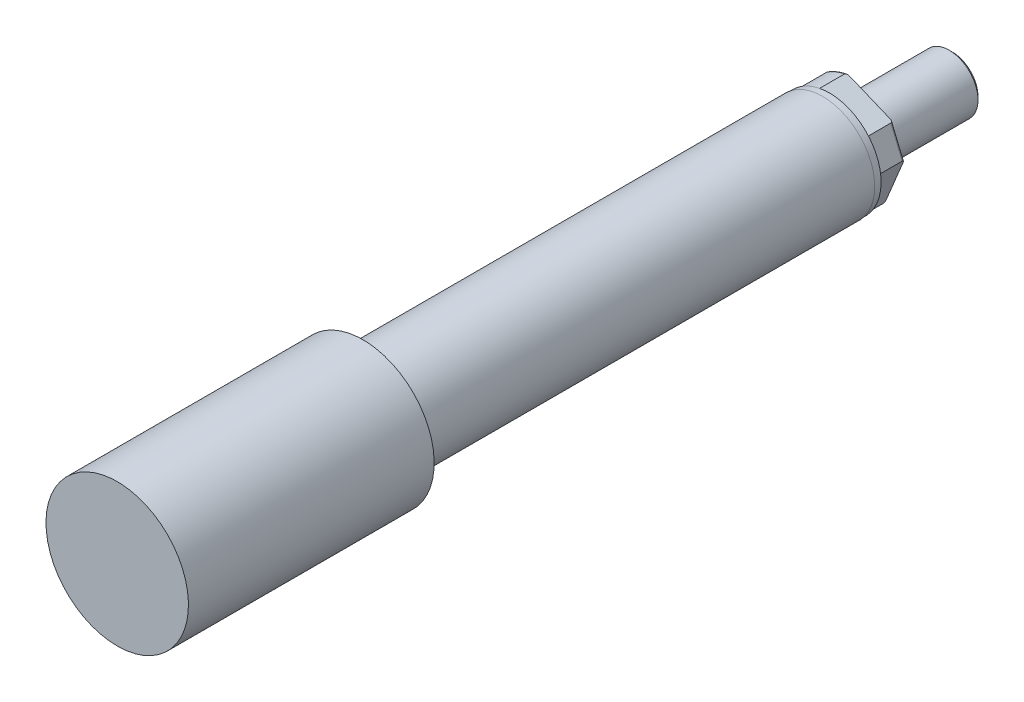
ISO-10303-21;
HEADER;
FILE_DESCRIPTION(('STEP AP214'),'2;1');
FILE_NAME('part.step','',(''),(''),'','','');
FILE_SCHEMA(('AUTOMOTIVE_DESIGN { 1 0 10303 214 1 1 1 1 }'));
ENDSEC;
DATA;
#1=APPLICATION_CONTEXT('core data for automotive mechanical design processes');
#2=APPLICATION_PROTOCOL_DEFINITION('international standard','automotive_design',2000,#1);
#3=PRODUCT_CONTEXT('',#1,'mechanical');
#4=PRODUCT('Part','Part','',(#3));
#5=PRODUCT_RELATED_PRODUCT_CATEGORY('part','',(#4));
#6=PRODUCT_DEFINITION_FORMATION('','',#4);
#7=PRODUCT_DEFINITION_CONTEXT('part definition',#1,'design');
#8=PRODUCT_DEFINITION('design','',#6,#7);
#9=PRODUCT_DEFINITION_SHAPE('','',#8);
#10=(LENGTH_UNIT() NAMED_UNIT(*) SI_UNIT(.MILLI.,.METRE.));
#11=(NAMED_UNIT(*) PLANE_ANGLE_UNIT() SI_UNIT($,.RADIAN.));
#12=(NAMED_UNIT(*) SI_UNIT($,.STERADIAN.) SOLID_ANGLE_UNIT());
#13=UNCERTAINTY_MEASURE_WITH_UNIT(LENGTH_MEASURE(1.E-05),#10,'distance_accuracy_value','');
#14=(GEOMETRIC_REPRESENTATION_CONTEXT(3) GLOBAL_UNCERTAINTY_ASSIGNED_CONTEXT((#13)) GLOBAL_UNIT_ASSIGNED_CONTEXT((#10,
#11,#12)) REPRESENTATION_CONTEXT('',''));
#15=CARTESIAN_POINT('',(0.,0.,0.));
#16=DIRECTION('',(0.,0.,1.));
#17=DIRECTION('',(1.,0.,0.));
#18=AXIS2_PLACEMENT_3D('',#15,#16,#17);
#19=CARTESIAN_POINT('',(0.,0.,-310.0327999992));
#20=DIRECTION('',(0.,0.,1.));
#21=DIRECTION('',(0.923879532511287,-0.382683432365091,0.));
#22=AXIS2_PLACEMENT_3D('',#19,#20,#21);
#23=CYLINDRICAL_SURFACE('',#22,37.719);
#24=CARTESIAN_POINT('',(0.,0.,-370.1799999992));
#25=DIRECTION('',(0.,0.,1.));
#26=DIRECTION('',(0.923879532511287,-0.382683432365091,0.));
#27=AXIS2_PLACEMENT_3D('',#24,#25,#26);
#28=CIRCLE('',#27,37.719);
#29=CARTESIAN_POINT('',(34.8478120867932,-14.4344363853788,-370.1799999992));
#30=VERTEX_POINT('',#29);
#31=EDGE_CURVE('E137',#30,#30,#28,.T.);
#32=ORIENTED_EDGE('',*,*,#31,.F.);
#33=EDGE_LOOP('',(#32));
#34=FACE_BOUND('',#33,.T.);
#35=CARTESIAN_POINT('',(0.,0.,-375.1799999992));
#36=DIRECTION('',(0.,0.,-1.));
#37=DIRECTION('',(-0.923879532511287,0.382683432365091,0.));
#38=AXIS2_PLACEMENT_3D('',#35,#36,#37);
#39=CIRCLE('',#38,37.719);
#40=CARTESIAN_POINT('',(-34.8478120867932,14.4344363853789,-375.1799999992));
#41=VERTEX_POINT('',#40);
#42=EDGE_CURVE('E173',#41,#41,#39,.T.);
#43=ORIENTED_EDGE('',*,*,#42,.F.);
#44=EDGE_LOOP('',(#43));
#45=FACE_BOUND('',#44,.T.);
#46=ADVANCED_FACE('F16',(#34,#45),#23,.T.);
#47=CARTESIAN_POINT('',(14.4344363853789,34.8478120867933,-395.1799999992));
#48=DIRECTION('',(0.,0.,1.));
#49=DIRECTION('',(0.923879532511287,-0.382683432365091,0.));
#50=AXIS2_PLACEMENT_3D('',#47,#48,#49);
#51=PLANE('',#50);
#52=CARTESIAN_POINT('',(0.,0.,-395.1799999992));
#53=DIRECTION('',(0.,0.,1.));
#54=DIRECTION('',(0.923879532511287,-0.382683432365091,0.));
#55=AXIS2_PLACEMENT_3D('',#52,#53,#54);
#56=CIRCLE('',#55,18.495999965);
#57=CARTESIAN_POINT('',(17.088075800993,-7.07811275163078,-395.1799999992));
#58=VERTEX_POINT('',#57);
#59=EDGE_CURVE('E158',#58,#58,#56,.T.);
#60=ORIENTED_EDGE('',*,*,#59,.T.);
#61=EDGE_LOOP('',(#60));
#62=FACE_BOUND('',#61,.T.);
#63=DIRECTION('',(0.923879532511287,-0.382683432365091,0.));
#64=VECTOR('',#63,1.);
#65=CARTESIAN_POINT('',(40.5034519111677,16.7770791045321,-395.1799999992));
#66=LINE('',#65,#64);
#67=CARTESIAN_POINT('',(-4.93911886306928,35.6000082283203,-395.1799999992));
#68=VERTEX_POINT('',#67);
#69=CARTESIAN_POINT('',(24.3744280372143,23.4579395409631,-395.1799999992));
#70=VERTEX_POINT('',#69);
#71=EDGE_CURVE('E153',#68,#70,#66,.T.);
#72=ORIENTED_EDGE('',*,*,#71,.T.);
#73=DIRECTION('',(-0.382683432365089,0.923879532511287,0.));
#74=VECTOR('',#73,1.);
#75=CARTESIAN_POINT('',(18.8918219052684,36.6941216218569,-395.1799999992));
#76=LINE('',#75,#74);
#77=CARTESIAN_POINT('',(33.8225914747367,0.648055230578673,-395.1799999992));
#78=VERTEX_POINT('',#77);
#79=EDGE_CURVE('E269',#70,#78,#76,.F.);
#80=ORIENTED_EDGE('',*,*,#79,.T.);
#81=DIRECTION('',(-0.382683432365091,-0.923879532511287,0.));
#82=VECTOR('',#81,1.);
#83=CARTESIAN_POINT('',(40.5034519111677,16.7770791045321,-395.1799999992));
#84=LINE('',#83,#82);
#85=CARTESIAN_POINT('',(21.6805227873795,-28.6654916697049,-395.1799999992));
#86=VERTEX_POINT('',#85);
#87=EDGE_CURVE('E143',#78,#86,#84,.T.);
#88=ORIENTED_EDGE('',*,*,#87,.T.);
#89=CARTESIAN_POINT('',(0.,0.,-395.1799999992));
#90=DIRECTION('',(0.,0.,1.));
#91=DIRECTION('',(0.923879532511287,-0.382683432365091,0.));
#92=AXIS2_PLACEMENT_3D('',#89,#90,#91);
#93=CIRCLE('',#92,35.941);
#94=CARTESIAN_POINT('',(4.93911886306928,-35.6000082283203,-395.1799999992));
#95=VERTEX_POINT('',#94);
#96=EDGE_CURVE('E284',#86,#95,#93,.F.);
#97=ORIENTED_EDGE('',*,*,#96,.T.);
#98=DIRECTION('',(-0.923879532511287,0.382683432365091,0.));
#99=VECTOR('',#98,1.);
#100=CARTESIAN_POINT('',(16.7770791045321,-40.5034519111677,-395.1799999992));
#101=LINE('',#100,#99);
#102=CARTESIAN_POINT('',(-28.6654916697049,-21.6805227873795,-395.1799999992));
#103=VERTEX_POINT('',#102);
#104=EDGE_CURVE('E146',#95,#103,#101,.T.);
#105=ORIENTED_EDGE('',*,*,#104,.T.);
#106=CARTESIAN_POINT('',(0.,0.,-395.1799999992));
#107=DIRECTION('',(0.,0.,1.));
#108=DIRECTION('',(0.923879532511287,-0.382683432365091,0.));
#109=AXIS2_PLACEMENT_3D('',#106,#107,#108);
#110=CIRCLE('',#109,35.941);
#111=CARTESIAN_POINT('',(-35.6000082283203,-4.93911886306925,-395.1799999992));
#112=VERTEX_POINT('',#111);
#113=EDGE_CURVE('E282',#103,#112,#110,.F.);
#114=ORIENTED_EDGE('',*,*,#113,.T.);
#115=DIRECTION('',(0.382683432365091,0.923879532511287,0.));
#116=VECTOR('',#115,1.);
#117=CARTESIAN_POINT('',(-16.777079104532,40.5034519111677,-395.1799999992));
#118=LINE('',#117,#116);
#119=CARTESIAN_POINT('',(-21.6805227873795,28.6654916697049,-395.1799999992));
#120=VERTEX_POINT('',#119);
#121=EDGE_CURVE('E150',#112,#120,#118,.T.);
#122=ORIENTED_EDGE('',*,*,#121,.T.);
#123=CARTESIAN_POINT('',(0.,0.,-395.1799999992));
#124=DIRECTION('',(0.,0.,1.));
#125=DIRECTION('',(0.923879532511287,-0.382683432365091,0.));
#126=AXIS2_PLACEMENT_3D('',#123,#124,#125);
#127=CIRCLE('',#126,35.941);
#128=EDGE_CURVE('E285',#120,#68,#127,.F.);
#129=ORIENTED_EDGE('',*,*,#128,.T.);
#130=EDGE_LOOP('',(#72,#80,#88,#97,#105,#114,#122,#129));
#131=FACE_BOUND('',#130,.T.);
#132=ADVANCED_FACE('F235',(#62,#131),#51,.F.);
#133=CARTESIAN_POINT('',(16.7770791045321,-40.5034519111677,-375.1799999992));
#134=DIRECTION('',(-0.382683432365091,-0.923879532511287,0.));
#135=DIRECTION('',(0.,0.,-1.));
#136=AXIS2_PLACEMENT_3D('',#133,#134,#135);
#137=PLANE('',#136);
#138=ORIENTED_EDGE('',*,*,#104,.F.);
#139=CARTESIAN_POINT('',(4.93911886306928,-35.6000082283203,-395.1799999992));
#140=CARTESIAN_POINT('',(4.99832987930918,-35.6245342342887,-395.179997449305));
#141=CARTESIAN_POINT('',(5.05753718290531,-35.6490587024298,-395.178965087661));
#142=CARTESIAN_POINT('',(5.17589592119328,-35.698084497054,-395.174771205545));
#143=CARTESIAN_POINT('',(5.2350473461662,-35.7225858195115,-395.171609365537));
#144=CARTESIAN_POINT('',(5.41269190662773,-35.7961686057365,-395.158798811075));
#145=CARTESIAN_POINT('',(5.53100031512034,-35.8451735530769,-395.145824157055));
#146=CARTESIAN_POINT('',(5.76714438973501,-35.9429876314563,-395.110075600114));
#147=CARTESIAN_POINT('',(5.88497196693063,-35.9917934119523,-395.087238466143));
#148=CARTESIAN_POINT('',(6.11821347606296,-36.0884052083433,-395.030530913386));
#149=CARTESIAN_POINT('',(6.23363092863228,-36.1362126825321,-394.996677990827));
#150=CARTESIAN_POINT('',(6.43254813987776,-36.2186068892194,-394.926075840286));
#151=CARTESIAN_POINT('',(6.51688700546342,-36.2535411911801,-394.89210972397));
#152=CARTESIAN_POINT('',(6.6823092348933,-36.322061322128,-394.815821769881));
#153=CARTESIAN_POINT('',(6.76339350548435,-36.355647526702,-394.773502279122));
#154=CARTESIAN_POINT('',(6.92130537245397,-36.4210567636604,-394.678775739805));
#155=CARTESIAN_POINT('',(6.99809311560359,-36.452863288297,-394.626289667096));
#156=CARTESIAN_POINT('',(7.14387346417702,-36.5132474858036,-394.509776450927));
#157=CARTESIAN_POINT('',(7.21288086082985,-36.5418312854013,-394.445771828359));
#158=CARTESIAN_POINT('',(7.31526105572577,-36.5842385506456,-394.330741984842));
#159=CARTESIAN_POINT('',(7.35238511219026,-36.5996158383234,-394.283646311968));
#160=CARTESIAN_POINT('',(7.41994876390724,-36.627601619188,-394.184077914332));
#161=CARTESIAN_POINT('',(7.45039435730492,-36.6402125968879,-394.131610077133));
#162=CARTESIAN_POINT('',(7.49865078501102,-36.6602010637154,-394.029833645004));
#163=CARTESIAN_POINT('',(7.51766185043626,-36.6680757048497,-393.981197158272));
#164=CARTESIAN_POINT('',(7.54789053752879,-36.6805968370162,-393.88119484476));
#165=CARTESIAN_POINT('',(7.55912658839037,-36.6852509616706,-393.829835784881));
#166=CARTESIAN_POINT('',(7.56865990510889,-36.6891997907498,-393.757679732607));
#167=CARTESIAN_POINT('',(7.57066753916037,-36.6900313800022,-393.737405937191));
#168=CARTESIAN_POINT('',(7.57334922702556,-36.691142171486,-393.696758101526));
#169=CARTESIAN_POINT('',(7.57402345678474,-36.6914214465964,-393.676384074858));
#170=CARTESIAN_POINT('',(7.57402314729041,-36.6914213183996,-393.6559999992));
#171=B_SPLINE_CURVE_WITH_KNOTS('',3,(#139,#140,#141,#142,#143,#144,#145,#146,#147,#148,#149,
#150,#151,#152,#153,#154,#155,#156,#157,#158,#159,#160,#161,#162,#163,#164,#165,#166,#167,#168,
#169,#170),.UNSPECIFIED.,.F.,.F.,(4,2,2,2,2,2,2,2,2,2,2,2,2,2,2,4),(0.,0.19225105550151,
0.384530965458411,0.770306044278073,1.15859203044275,1.54626429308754,1.83813426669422,
2.12992235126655,2.42407675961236,2.7176621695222,2.90288017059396,3.08793113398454,
3.24573831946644,3.40317015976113,3.46429781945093,3.52541741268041),.UNSPECIFIED.);
#172=CARTESIAN_POINT('',(7.5740231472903,-36.6914213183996,-393.6559999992));
#173=VERTEX_POINT('',#172);
#174=EDGE_CURVE('E248',#95,#173,#171,.T.);
#175=ORIENTED_EDGE('',*,*,#174,.T.);
#176=DIRECTION('',(0.,0.,-1.));
#177=VECTOR('',#176,1.);
#178=CARTESIAN_POINT('',(7.5740231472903,-36.6914213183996,-267.427702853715));
#179=LINE('',#178,#177);
#180=CARTESIAN_POINT('',(7.5740231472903,-36.6914213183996,-375.1799999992));
#181=VERTEX_POINT('',#180);
#182=EDGE_CURVE('E316',#173,#181,#179,.F.);
#183=ORIENTED_EDGE('',*,*,#182,.T.);
#184=DIRECTION('',(-0.923879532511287,0.382683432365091,0.));
#185=VECTOR('',#184,1.);
#186=CARTESIAN_POINT('',(16.7770791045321,-40.5034519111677,-375.1799999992));
#187=LINE('',#186,#185);
#188=CARTESIAN_POINT('',(-31.3003959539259,-20.5891096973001,-375.1799999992));
#189=VERTEX_POINT('',#188);
#190=EDGE_CURVE('E134',#181,#189,#187,.T.);
#191=ORIENTED_EDGE('',*,*,#190,.T.);
#192=DIRECTION('',(0.,0.,-1.));
#193=VECTOR('',#192,1.);
#194=CARTESIAN_POINT('',(-31.3003959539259,-20.5891096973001,-267.427702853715));
#195=LINE('',#194,#193);
#196=CARTESIAN_POINT('',(-31.3003959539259,-20.5891096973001,-393.6559999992));
#197=VERTEX_POINT('',#196);
#198=EDGE_CURVE('E121',#189,#197,#195,.T.);
#199=ORIENTED_EDGE('',*,*,#198,.T.);
#200=CARTESIAN_POINT('',(-31.3003959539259,-20.5891096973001,-393.6559999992));
#201=CARTESIAN_POINT('',(-31.3004118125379,-20.5891031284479,-393.686203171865));
#202=CARTESIAN_POINT('',(-31.2989193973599,-20.5897213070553,-393.716395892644));
#203=CARTESIAN_POINT('',(-31.2930415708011,-20.5921559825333,-393.776407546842));
#204=CARTESIAN_POINT('',(-31.2886603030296,-20.5939707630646,-393.806226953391));
#205=CARTESIAN_POINT('',(-31.2772021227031,-20.598716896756,-393.864846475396));
#206=CARTESIAN_POINT('',(-31.270160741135,-20.6016335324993,-393.893654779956));
#207=CARTESIAN_POINT('',(-31.2535839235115,-20.60849987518,-393.950415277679));
#208=CARTESIAN_POINT('',(-31.2440477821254,-20.6124498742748,-393.978367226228));
#209=CARTESIAN_POINT('',(-31.2121642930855,-20.6256564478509,-394.060335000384));
#210=CARTESIAN_POINT('',(-31.1864612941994,-20.6363029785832,-394.112849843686));
#211=CARTESIAN_POINT('',(-31.1279804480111,-20.6605265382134,-394.213146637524));
#212=CARTESIAN_POINT('',(-31.0951775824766,-20.6741139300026,-394.260910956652));
#213=CARTESIAN_POINT('',(-31.003724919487,-20.711994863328,-394.377743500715));
#214=CARTESIAN_POINT('',(-30.9410998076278,-20.7379350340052,-394.443153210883));
#215=CARTESIAN_POINT('',(-30.8074439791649,-20.7932970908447,-394.562855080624));
#216=CARTESIAN_POINT('',(-30.7363963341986,-20.8227259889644,-394.617124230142));
#217=CARTESIAN_POINT('',(-30.5996359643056,-20.8793739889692,-394.708806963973));
#218=CARTESIAN_POINT('',(-30.5346551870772,-20.9062899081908,-394.747524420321));
#219=CARTESIAN_POINT('',(-30.4018382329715,-20.9613044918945,-394.81879354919));
#220=CARTESIAN_POINT('',(-30.3339999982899,-20.989404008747,-394.851340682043));
#221=CARTESIAN_POINT('',(-30.1960424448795,-21.0465478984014,-394.911059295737));
#222=CARTESIAN_POINT('',(-30.1259151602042,-21.0755955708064,-394.938208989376));
#223=CARTESIAN_POINT('',(-29.9841814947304,-21.1343035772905,-394.987552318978));
#224=CARTESIAN_POINT('',(-29.9125747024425,-21.1639640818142,-395.009744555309));
#225=CARTESIAN_POINT('',(-29.7438693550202,-21.2338441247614,-395.056387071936));
#226=CARTESIAN_POINT('',(-29.646350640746,-21.2742376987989,-395.079056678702));
#227=CARTESIAN_POINT('',(-29.4500861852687,-21.3555330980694,-395.117195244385));
#228=CARTESIAN_POINT('',(-29.3513397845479,-21.3964351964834,-395.132660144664));
#229=CARTESIAN_POINT('',(-29.1548151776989,-21.4778383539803,-395.156800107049));
#230=CARTESIAN_POINT('',(-29.0570481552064,-21.5183347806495,-395.165583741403));
#231=CARTESIAN_POINT('',(-28.861343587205,-21.5993982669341,-395.177167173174));
#232=CARTESIAN_POINT('',(-28.7634064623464,-21.6399651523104,-395.17997519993));
#233=CARTESIAN_POINT('',(-28.6654916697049,-21.6805227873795,-395.1799999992));
#234=B_SPLINE_CURVE_WITH_KNOTS('',3,(#200,#201,#202,#203,#204,#205,#206,#207,#208,#209,#210,
#211,#212,#213,#214,#215,#216,#217,#218,#219,#220,#221,#222,#223,#224,#225,#226,#227,#228,#229,
#230,#231,#232,#233),.UNSPECIFIED.,.F.,.F.,(4,2,2,2,2,2,2,2,2,2,2,2,2,2,2,2,4),(0.,
0.0905495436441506,0.180969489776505,0.270222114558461,0.359500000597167,0.536883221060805,
0.714901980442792,0.99589363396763,1.27745994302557,1.51798351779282,1.75868337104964,
2.00033593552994,2.24205663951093,2.5656411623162,2.88940775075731,3.20779349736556,
3.52574049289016),.UNSPECIFIED.);
#235=EDGE_CURVE('E242',#197,#103,#234,.T.);
#236=ORIENTED_EDGE('',*,*,#235,.T.);
#237=EDGE_LOOP('',(#138,#175,#183,#191,#199,#236));
#238=FACE_BOUND('',#237,.T.);
#239=ADVANCED_FACE('F230',(#238),#137,.T.);
#240=CARTESIAN_POINT('',(-16.777079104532,40.5034519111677,-375.1799999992));
#241=DIRECTION('',(-0.923879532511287,0.382683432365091,0.));
#242=DIRECTION('',(-0.382683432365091,-0.923879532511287,0.));
#243=AXIS2_PLACEMENT_3D('',#240,#241,#242);
#244=PLANE('',#243);
#245=ORIENTED_EDGE('',*,*,#121,.F.);
#246=CARTESIAN_POINT('',(-35.6000082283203,-4.93911886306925,-395.1799999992));
#247=CARTESIAN_POINT('',(-35.6245342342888,-4.99832987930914,-395.179997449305));
#248=CARTESIAN_POINT('',(-35.6490587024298,-5.05753718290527,-395.178965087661));
#249=CARTESIAN_POINT('',(-35.698084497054,-5.17589592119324,-395.174771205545));
#250=CARTESIAN_POINT('',(-35.7225858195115,-5.23504734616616,-395.171609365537));
#251=CARTESIAN_POINT('',(-35.7961686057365,-5.41269190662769,-395.158798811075));
#252=CARTESIAN_POINT('',(-35.8451735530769,-5.53100031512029,-395.145824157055));
#253=CARTESIAN_POINT('',(-35.9429876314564,-5.76714438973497,-395.110075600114));
#254=CARTESIAN_POINT('',(-35.9917934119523,-5.88497196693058,-395.087238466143));
#255=CARTESIAN_POINT('',(-36.0884052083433,-6.11821347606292,-395.030530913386));
#256=CARTESIAN_POINT('',(-36.1362126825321,-6.23363092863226,-394.996677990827));
#257=CARTESIAN_POINT('',(-36.2186068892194,-6.43254813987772,-394.926075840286));
#258=CARTESIAN_POINT('',(-36.2535411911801,-6.51688700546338,-394.89210972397));
#259=CARTESIAN_POINT('',(-36.322061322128,-6.68230923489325,-394.815821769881));
#260=CARTESIAN_POINT('',(-36.355647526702,-6.76339350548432,-394.773502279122));
#261=CARTESIAN_POINT('',(-36.4210567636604,-6.92130537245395,-394.678775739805));
#262=CARTESIAN_POINT('',(-36.452863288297,-6.99809311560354,-394.626289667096));
#263=CARTESIAN_POINT('',(-36.5132474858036,-7.14387346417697,-394.509776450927));
#264=CARTESIAN_POINT('',(-36.5418312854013,-7.21288086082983,-394.445771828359));
#265=CARTESIAN_POINT('',(-36.5842385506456,-7.31526105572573,-394.330741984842));
#266=CARTESIAN_POINT('',(-36.5996158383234,-7.3523851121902,-394.283646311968));
#267=CARTESIAN_POINT('',(-36.6276016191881,-7.41994876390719,-394.184077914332));
#268=CARTESIAN_POINT('',(-36.6402125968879,-7.4503943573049,-394.131610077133));
#269=CARTESIAN_POINT('',(-36.6602010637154,-7.49865078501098,-394.029833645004));
#270=CARTESIAN_POINT('',(-36.6680757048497,-7.51766185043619,-393.981197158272));
#271=CARTESIAN_POINT('',(-36.6805968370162,-7.54789053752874,-393.88119484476));
#272=CARTESIAN_POINT('',(-36.6852509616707,-7.55912658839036,-393.829835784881));
#273=CARTESIAN_POINT('',(-36.6891997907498,-7.56865990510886,-393.757679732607));
#274=CARTESIAN_POINT('',(-36.6900313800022,-7.57066753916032,-393.737405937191));
#275=CARTESIAN_POINT('',(-36.691142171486,-7.5733492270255,-393.696758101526));
#276=CARTESIAN_POINT('',(-36.6914214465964,-7.57402345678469,-393.676384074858));
#277=CARTESIAN_POINT('',(-36.6914213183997,-7.57402314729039,-393.6559999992));
#278=B_SPLINE_CURVE_WITH_KNOTS('',3,(#246,#247,#248,#249,#250,#251,#252,#253,#254,#255,#256,
#257,#258,#259,#260,#261,#262,#263,#264,#265,#266,#267,#268,#269,#270,#271,#272,#273,#274,#275,
#276,#277),.UNSPECIFIED.,.F.,.F.,(4,2,2,2,2,2,2,2,2,2,2,2,2,2,2,4),(0.,0.192251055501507,
0.384530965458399,0.770306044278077,1.15859203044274,1.54626429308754,1.83813426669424,
2.12992235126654,2.42407675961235,2.7176621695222,2.90288017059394,3.08793113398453,
3.24573831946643,3.40317015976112,3.46429781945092,3.5254174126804),.UNSPECIFIED.);
#279=CARTESIAN_POINT('',(-36.6914213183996,-7.57402314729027,-393.6559999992));
#280=VERTEX_POINT('',#279);
#281=EDGE_CURVE('E33',#112,#280,#278,.T.);
#282=ORIENTED_EDGE('',*,*,#281,.T.);
#283=DIRECTION('',(0.,0.,-1.));
#284=VECTOR('',#283,1.);
#285=CARTESIAN_POINT('',(-36.6914213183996,-7.57402314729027,-267.427702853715));
#286=LINE('',#285,#284);
#287=CARTESIAN_POINT('',(-36.6914213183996,-7.57402314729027,-375.1799999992));
#288=VERTEX_POINT('',#287);
#289=EDGE_CURVE('E107',#280,#288,#286,.F.);
#290=ORIENTED_EDGE('',*,*,#289,.T.);
#291=DIRECTION('',(0.382683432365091,0.923879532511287,0.));
#292=VECTOR('',#291,1.);
#293=CARTESIAN_POINT('',(-16.777079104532,40.5034519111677,-375.1799999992));
#294=LINE('',#293,#292);
#295=CARTESIAN_POINT('',(-20.5891096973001,31.3003959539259,-375.1799999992));
#296=VERTEX_POINT('',#295);
#297=EDGE_CURVE('E111',#288,#296,#294,.T.);
#298=ORIENTED_EDGE('',*,*,#297,.T.);
#299=DIRECTION('',(0.,0.,-1.));
#300=VECTOR('',#299,1.);
#301=CARTESIAN_POINT('',(-20.5891096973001,31.3003959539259,-267.427702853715));
#302=LINE('',#301,#300);
#303=CARTESIAN_POINT('',(-20.5891096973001,31.3003959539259,-393.6559999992));
#304=VERTEX_POINT('',#303);
#305=EDGE_CURVE('E114',#296,#304,#302,.T.);
#306=ORIENTED_EDGE('',*,*,#305,.T.);
#307=CARTESIAN_POINT('',(-20.5891096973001,31.3003959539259,-393.6559999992));
#308=CARTESIAN_POINT('',(-20.5891031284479,31.300411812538,-393.686203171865));
#309=CARTESIAN_POINT('',(-20.5897213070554,31.2989193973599,-393.716395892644));
#310=CARTESIAN_POINT('',(-20.5921559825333,31.2930415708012,-393.776407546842));
#311=CARTESIAN_POINT('',(-20.5939707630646,31.2886603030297,-393.806226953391));
#312=CARTESIAN_POINT('',(-20.598716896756,31.2772021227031,-393.864846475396));
#313=CARTESIAN_POINT('',(-20.6016335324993,31.270160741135,-393.893654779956));
#314=CARTESIAN_POINT('',(-20.60849987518,31.2535839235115,-393.950415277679));
#315=CARTESIAN_POINT('',(-20.6124498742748,31.2440477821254,-393.978367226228));
#316=CARTESIAN_POINT('',(-20.6256564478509,31.2121642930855,-394.060335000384));
#317=CARTESIAN_POINT('',(-20.6363029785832,31.1864612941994,-394.112849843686));
#318=CARTESIAN_POINT('',(-20.6605265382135,31.1279804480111,-394.213146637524));
#319=CARTESIAN_POINT('',(-20.6741139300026,31.0951775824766,-394.260910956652));
#320=CARTESIAN_POINT('',(-20.711994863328,31.003724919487,-394.377743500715));
#321=CARTESIAN_POINT('',(-20.7379350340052,30.9410998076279,-394.443153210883));
#322=CARTESIAN_POINT('',(-20.7932970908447,30.8074439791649,-394.562855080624));
#323=CARTESIAN_POINT('',(-20.8227259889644,30.7363963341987,-394.617124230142));
#324=CARTESIAN_POINT('',(-20.8793739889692,30.5996359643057,-394.708806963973));
#325=CARTESIAN_POINT('',(-20.9062899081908,30.5346551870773,-394.747524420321));
#326=CARTESIAN_POINT('',(-20.9613044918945,30.4018382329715,-394.81879354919));
#327=CARTESIAN_POINT('',(-20.989404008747,30.3339999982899,-394.851340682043));
#328=CARTESIAN_POINT('',(-21.0465478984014,30.1960424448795,-394.911059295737));
#329=CARTESIAN_POINT('',(-21.0755955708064,30.1259151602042,-394.938208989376));
#330=CARTESIAN_POINT('',(-21.1343035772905,29.9841814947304,-394.987552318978));
#331=CARTESIAN_POINT('',(-21.1639640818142,29.9125747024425,-395.009744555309));
#332=CARTESIAN_POINT('',(-21.2338441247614,29.7438693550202,-395.056387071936));
#333=CARTESIAN_POINT('',(-21.2742376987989,29.646350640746,-395.079056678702));
#334=CARTESIAN_POINT('',(-21.3555330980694,29.4500861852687,-395.117195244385));
#335=CARTESIAN_POINT('',(-21.3964351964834,29.3513397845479,-395.132660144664));
#336=CARTESIAN_POINT('',(-21.4778383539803,29.1548151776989,-395.156800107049));
#337=CARTESIAN_POINT('',(-21.5183347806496,29.0570481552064,-395.165583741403));
#338=CARTESIAN_POINT('',(-21.5993982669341,28.861343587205,-395.177167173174));
#339=CARTESIAN_POINT('',(-21.6399651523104,28.7634064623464,-395.17997519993));
#340=CARTESIAN_POINT('',(-21.6805227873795,28.6654916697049,-395.1799999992));
#341=B_SPLINE_CURVE_WITH_KNOTS('',3,(#307,#308,#309,#310,#311,#312,#313,#314,#315,#316,#317,
#318,#319,#320,#321,#322,#323,#324,#325,#326,#327,#328,#329,#330,#331,#332,#333,#334,#335,#336,
#337,#338,#339,#340),.UNSPECIFIED.,.F.,.F.,(4,2,2,2,2,2,2,2,2,2,2,2,2,2,2,2,4),(0.,
0.0905495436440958,0.180969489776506,0.270222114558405,0.359500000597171,0.536883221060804,
0.714901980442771,0.995893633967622,1.27745994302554,1.51798351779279,1.75868337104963,
2.00033593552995,2.24205663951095,2.56564116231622,2.88940775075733,3.20779349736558,
3.52574049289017),.UNSPECIFIED.);
#342=EDGE_CURVE('E213',#304,#120,#341,.T.);
#343=ORIENTED_EDGE('',*,*,#342,.T.);
#344=EDGE_LOOP('',(#245,#282,#290,#298,#306,#343));
#345=FACE_BOUND('',#344,.T.);
#346=ADVANCED_FACE('F109',(#345),#244,.T.);
#347=CARTESIAN_POINT('',(40.5034519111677,16.7770791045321,-375.1799999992));
#348=DIRECTION('',(0.382683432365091,0.923879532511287,0.));
#349=DIRECTION('',(0.,0.,1.));
#350=AXIS2_PLACEMENT_3D('',#347,#348,#349);
#351=PLANE('',#350);
#352=DIRECTION('',(0.,0.,1.));
#353=VECTOR('',#352,1.);
#354=CARTESIAN_POINT('',(26.3656299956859,22.6331566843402,-375.1799999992));
#355=LINE('',#354,#353);
#356=CARTESIAN_POINT('',(26.3656299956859,22.6331566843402,-393.6559999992));
#357=VERTEX_POINT('',#356);
#358=CARTESIAN_POINT('',(26.3656299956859,22.6331566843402,-375.1799999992));
#359=VERTEX_POINT('',#358);
#360=EDGE_CURVE('E292',#357,#359,#355,.T.);
#361=ORIENTED_EDGE('',*,*,#360,.F.);
#362=CARTESIAN_POINT('',(24.3744280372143,23.4579395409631,-393.6559999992));
#363=DIRECTION('',(0.382683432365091,0.923879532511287,0.));
#364=DIRECTION('',(-0.923879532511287,0.382683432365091,0.));
#365=AXIS2_PLACEMENT_3D('',#362,#363,#364);
#366=ELLIPSE('',#365,2.15526146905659,1.524);
#367=EDGE_CURVE('E193',#357,#70,#366,.T.);
#368=ORIENTED_EDGE('',*,*,#367,.T.);
#369=ORIENTED_EDGE('',*,*,#71,.F.);
#370=CARTESIAN_POINT('',(-4.93911886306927,35.6000082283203,-395.1799999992));
#371=CARTESIAN_POINT('',(-4.99832987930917,35.6245342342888,-395.179997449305));
#372=CARTESIAN_POINT('',(-5.05753718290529,35.6490587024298,-395.178965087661));
#373=CARTESIAN_POINT('',(-5.17589592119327,35.6980844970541,-395.174771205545));
#374=CARTESIAN_POINT('',(-5.23504734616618,35.7225858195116,-395.171609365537));
#375=CARTESIAN_POINT('',(-5.41269190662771,35.7961686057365,-395.158798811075));
#376=CARTESIAN_POINT('',(-5.53100031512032,35.845173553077,-395.145824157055));
#377=CARTESIAN_POINT('',(-5.767144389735,35.9429876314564,-395.110075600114));
#378=CARTESIAN_POINT('',(-5.88497196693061,35.9917934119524,-395.087238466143));
#379=CARTESIAN_POINT('',(-6.11821347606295,36.0884052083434,-395.030530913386));
#380=CARTESIAN_POINT('',(-6.23363092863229,36.1362126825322,-394.996677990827));
#381=CARTESIAN_POINT('',(-6.43254813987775,36.2186068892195,-394.926075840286));
#382=CARTESIAN_POINT('',(-6.5168870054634,36.2535411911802,-394.89210972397));
#383=CARTESIAN_POINT('',(-6.68230923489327,36.322061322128,-394.815821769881));
#384=CARTESIAN_POINT('',(-6.76339350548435,36.355647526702,-394.773502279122));
#385=CARTESIAN_POINT('',(-6.92130537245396,36.4210567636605,-394.678775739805));
#386=CARTESIAN_POINT('',(-6.99809311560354,36.452863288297,-394.626289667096));
#387=CARTESIAN_POINT('',(-7.14387346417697,36.5132474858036,-394.509776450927));
#388=CARTESIAN_POINT('',(-7.21288086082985,36.5418312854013,-394.445771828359));
#389=CARTESIAN_POINT('',(-7.31526105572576,36.5842385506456,-394.330741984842));
#390=CARTESIAN_POINT('',(-7.35238511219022,36.5996158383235,-394.283646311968));
#391=CARTESIAN_POINT('',(-7.41994876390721,36.6276016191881,-394.184077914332));
#392=CARTESIAN_POINT('',(-7.45039435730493,36.640212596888,-394.131610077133));
#393=CARTESIAN_POINT('',(-7.498650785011,36.6602010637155,-394.029833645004));
#394=CARTESIAN_POINT('',(-7.51766185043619,36.6680757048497,-393.981197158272));
#395=CARTESIAN_POINT('',(-7.54789053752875,36.6805968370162,-393.88119484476));
#396=CARTESIAN_POINT('',(-7.5591265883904,36.6852509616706,-393.829835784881));
#397=CARTESIAN_POINT('',(-7.56865990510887,36.6891997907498,-393.757679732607));
#398=CARTESIAN_POINT('',(-7.57066753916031,36.6900313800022,-393.737405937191));
#399=CARTESIAN_POINT('',(-7.57334922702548,36.691142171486,-393.696758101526));
#400=CARTESIAN_POINT('',(-7.57402345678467,36.6914214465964,-393.676384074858));
#401=CARTESIAN_POINT('',(-7.5740231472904,36.6914213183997,-393.6559999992));
#402=B_SPLINE_CURVE_WITH_KNOTS('',3,(#370,#371,#372,#373,#374,#375,#376,#377,#378,#379,#380,
#381,#382,#383,#384,#385,#386,#387,#388,#389,#390,#391,#392,#393,#394,#395,#396,#397,#398,#399,
#400,#401),.UNSPECIFIED.,.F.,.F.,(4,2,2,2,2,2,2,2,2,2,2,2,2,2,2,4),(0.,0.192251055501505,
0.384530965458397,0.770306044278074,1.15859203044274,1.54626429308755,1.83813426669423,
2.12992235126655,2.42407675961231,2.71766216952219,2.90288017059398,3.08793113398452,
3.24573831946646,3.4031701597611,3.4642978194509,3.52541741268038),.UNSPECIFIED.);
#403=CARTESIAN_POINT('',(-7.57402314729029,36.6914213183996,-393.6559999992));
#404=VERTEX_POINT('',#403);
#405=EDGE_CURVE('E185',#68,#404,#402,.T.);
#406=ORIENTED_EDGE('',*,*,#405,.T.);
#407=DIRECTION('',(0.,0.,-1.));
#408=VECTOR('',#407,1.);
#409=CARTESIAN_POINT('',(-7.57402314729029,36.6914213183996,-267.427702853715));
#410=LINE('',#409,#408);
#411=CARTESIAN_POINT('',(-7.57402314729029,36.6914213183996,-375.1799999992));
#412=VERTEX_POINT('',#411);
#413=EDGE_CURVE('E115',#404,#412,#410,.F.);
#414=ORIENTED_EDGE('',*,*,#413,.T.);
#415=DIRECTION('',(0.923879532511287,-0.382683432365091,0.));
#416=VECTOR('',#415,1.);
#417=CARTESIAN_POINT('',(40.5034519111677,16.7770791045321,-375.1799999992));
#418=LINE('',#417,#416);
#419=EDGE_CURVE('E133',#412,#359,#418,.T.);
#420=ORIENTED_EDGE('',*,*,#419,.T.);
#421=EDGE_LOOP('',(#361,#368,#369,#406,#414,#420));
#422=FACE_BOUND('',#421,.T.);
#423=ADVANCED_FACE('F195',(#422),#351,.T.);
#424=CARTESIAN_POINT('',(40.5034519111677,16.7770791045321,-375.1799999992));
#425=DIRECTION('',(0.923879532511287,-0.382683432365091,0.));
#426=DIRECTION('',(0.382683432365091,0.923879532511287,0.));
#427=AXIS2_PLACEMENT_3D('',#424,#425,#426);
#428=PLANE('',#427);
#429=ORIENTED_EDGE('',*,*,#87,.F.);
#430=CARTESIAN_POINT('',(33.8225914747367,0.648055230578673,-393.6559999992));
#431=DIRECTION('',(0.923879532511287,-0.382683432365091,0.));
#432=DIRECTION('',(0.382683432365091,0.923879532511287,0.));
#433=AXIS2_PLACEMENT_3D('',#430,#431,#432);
#434=ELLIPSE('',#433,2.15526146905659,1.524);
#435=CARTESIAN_POINT('',(34.6473743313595,2.63925718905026,-393.6559999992));
#436=VERTEX_POINT('',#435);
#437=EDGE_CURVE('E268',#78,#436,#434,.T.);
#438=ORIENTED_EDGE('',*,*,#437,.T.);
#439=DIRECTION('',(0.,0.,-1.));
#440=VECTOR('',#439,1.);
#441=CARTESIAN_POINT('',(34.6473743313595,2.63925718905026,-375.1799999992));
#442=LINE('',#441,#440);
#443=CARTESIAN_POINT('',(34.6473743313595,2.63925718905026,-375.1799999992));
#444=VERTEX_POINT('',#443);
#445=EDGE_CURVE('E176',#444,#436,#442,.T.);
#446=ORIENTED_EDGE('',*,*,#445,.F.);
#447=DIRECTION('',(-0.382683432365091,-0.923879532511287,0.));
#448=VECTOR('',#447,1.);
#449=CARTESIAN_POINT('',(40.5034519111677,16.7770791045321,-375.1799999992));
#450=LINE('',#449,#448);
#451=CARTESIAN_POINT('',(20.5891096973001,-31.3003959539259,-375.1799999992));
#452=VERTEX_POINT('',#451);
#453=EDGE_CURVE('E139',#444,#452,#450,.T.);
#454=ORIENTED_EDGE('',*,*,#453,.T.);
#455=DIRECTION('',(0.,0.,-1.));
#456=VECTOR('',#455,1.);
#457=CARTESIAN_POINT('',(20.5891096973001,-31.3003959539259,-267.427702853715));
#458=LINE('',#457,#456);
#459=CARTESIAN_POINT('',(20.5891096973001,-31.3003959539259,-393.6559999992));
#460=VERTEX_POINT('',#459);
#461=EDGE_CURVE('E179',#452,#460,#458,.T.);
#462=ORIENTED_EDGE('',*,*,#461,.T.);
#463=CARTESIAN_POINT('',(20.5891096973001,-31.3003959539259,-393.6559999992));
#464=CARTESIAN_POINT('',(20.5891031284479,-31.3004118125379,-393.686203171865));
#465=CARTESIAN_POINT('',(20.5897213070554,-31.2989193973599,-393.716395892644));
#466=CARTESIAN_POINT('',(20.5921559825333,-31.2930415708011,-393.776407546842));
#467=CARTESIAN_POINT('',(20.5939707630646,-31.2886603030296,-393.806226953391));
#468=CARTESIAN_POINT('',(20.598716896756,-31.2772021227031,-393.864846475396));
#469=CARTESIAN_POINT('',(20.6016335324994,-31.270160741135,-393.893654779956));
#470=CARTESIAN_POINT('',(20.60849987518,-31.2535839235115,-393.950415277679));
#471=CARTESIAN_POINT('',(20.6124498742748,-31.2440477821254,-393.978367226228));
#472=CARTESIAN_POINT('',(20.6256564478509,-31.2121642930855,-394.060335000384));
#473=CARTESIAN_POINT('',(20.6363029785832,-31.1864612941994,-394.112849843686));
#474=CARTESIAN_POINT('',(20.6605265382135,-31.127980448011,-394.213146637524));
#475=CARTESIAN_POINT('',(20.6741139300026,-31.0951775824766,-394.260910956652));
#476=CARTESIAN_POINT('',(20.711994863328,-31.003724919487,-394.377743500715));
#477=CARTESIAN_POINT('',(20.7379350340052,-30.9410998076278,-394.443153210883));
#478=CARTESIAN_POINT('',(20.7932970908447,-30.8074439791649,-394.562855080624));
#479=CARTESIAN_POINT('',(20.8227259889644,-30.7363963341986,-394.617124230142));
#480=CARTESIAN_POINT('',(20.8793739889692,-30.5996359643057,-394.708806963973));
#481=CARTESIAN_POINT('',(20.9062899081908,-30.5346551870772,-394.747524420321));
#482=CARTESIAN_POINT('',(20.9613044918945,-30.4018382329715,-394.81879354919));
#483=CARTESIAN_POINT('',(20.9894040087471,-30.3339999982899,-394.851340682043));
#484=CARTESIAN_POINT('',(21.0465478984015,-30.1960424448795,-394.911059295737));
#485=CARTESIAN_POINT('',(21.0755955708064,-30.1259151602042,-394.938208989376));
#486=CARTESIAN_POINT('',(21.1343035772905,-29.9841814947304,-394.987552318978));
#487=CARTESIAN_POINT('',(21.1639640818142,-29.9125747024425,-395.009744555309));
#488=CARTESIAN_POINT('',(21.2338441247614,-29.7438693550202,-395.056387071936));
#489=CARTESIAN_POINT('',(21.2742376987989,-29.646350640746,-395.079056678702));
#490=CARTESIAN_POINT('',(21.3555330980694,-29.4500861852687,-395.117195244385));
#491=CARTESIAN_POINT('',(21.3964351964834,-29.3513397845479,-395.132660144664));
#492=CARTESIAN_POINT('',(21.4778383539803,-29.1548151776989,-395.156800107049));
#493=CARTESIAN_POINT('',(21.5183347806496,-29.0570481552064,-395.165583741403));
#494=CARTESIAN_POINT('',(21.5993982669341,-28.861343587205,-395.177167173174));
#495=CARTESIAN_POINT('',(21.6399651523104,-28.7634064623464,-395.17997519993));
#496=CARTESIAN_POINT('',(21.6805227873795,-28.6654916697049,-395.1799999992));
#497=B_SPLINE_CURVE_WITH_KNOTS('',3,(#463,#464,#465,#466,#467,#468,#469,#470,#471,#472,#473,
#474,#475,#476,#477,#478,#479,#480,#481,#482,#483,#484,#485,#486,#487,#488,#489,#490,#491,#492,
#493,#494,#495,#496),.UNSPECIFIED.,.F.,.F.,(4,2,2,2,2,2,2,2,2,2,2,2,2,2,2,2,4),(0.,
0.0905495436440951,0.180969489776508,0.270222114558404,0.359500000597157,0.536883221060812,
0.714901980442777,0.995893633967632,1.27745994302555,1.51798351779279,1.75868337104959,
2.00033593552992,2.24205663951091,2.56564116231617,2.88940775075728,3.20779349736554,
3.52574049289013),.UNSPECIFIED.);
#498=EDGE_CURVE('E262',#460,#86,#497,.T.);
#499=ORIENTED_EDGE('',*,*,#498,.T.);
#500=EDGE_LOOP('',(#429,#438,#446,#454,#462,#499));
#501=FACE_BOUND('',#500,.T.);
#502=ADVANCED_FACE('F237',(#501),#428,.T.);
#503=CARTESIAN_POINT('',(0.,0.,-465.0299999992));
#504=DIRECTION('',(0.,0.,1.));
#505=DIRECTION('',(0.923879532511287,-0.382683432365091,0.));
#506=AXIS2_PLACEMENT_3D('',#503,#504,#505);
#507=PLANE('',#506);
#508=CARTESIAN_POINT('',(0.,0.,-465.0299999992));
#509=DIRECTION('',(0.,0.,1.));
#510=DIRECTION('',(0.923879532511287,-0.382683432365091,0.));
#511=AXIS2_PLACEMENT_3D('',#508,#509,#510);
#512=CIRCLE('',#511,2.9845);
#513=CARTESIAN_POINT('',(2.75731846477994,-1.14211870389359,-465.0299999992));
#514=VERTEX_POINT('',#513);
#515=EDGE_CURVE('E147',#514,#514,#512,.T.);
#516=ORIENTED_EDGE('',*,*,#515,.T.);
#517=EDGE_LOOP('',(#516));
#518=FACE_BOUND('',#517,.T.);
#519=CARTESIAN_POINT('',(0.,0.,-465.0299999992));
#520=DIRECTION('',(0.,0.,1.));
#521=DIRECTION('',(0.923879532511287,-0.382683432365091,0.));
#522=AXIS2_PLACEMENT_3D('',#519,#520,#521);
#523=CIRCLE('',#522,18.714);
#524=CARTESIAN_POINT('',(17.2894815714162,-7.16153775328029,-465.0299999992));
#525=VERTEX_POINT('',#524);
#526=EDGE_CURVE('E170',#525,#525,#523,.F.);
#527=ORIENTED_EDGE('',*,*,#526,.T.);
#528=EDGE_LOOP('',(#527));
#529=FACE_BOUND('',#528,.T.);
#530=ADVANCED_FACE('F581',(#518,#529),#507,.F.);
#531=CARTESIAN_POINT('',(0.,0.,-310.0327999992));
#532=DIRECTION('',(0.,0.,1.));
#533=DIRECTION('',(0.923879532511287,-0.382683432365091,0.));
#534=AXIS2_PLACEMENT_3D('',#531,#532,#533);
#535=CYLINDRICAL_SURFACE('',#534,21.);
#536=CARTESIAN_POINT('',(0.,0.,-462.7439999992));
#537=DIRECTION('',(0.,0.,1.));
#538=DIRECTION('',(0.923879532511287,-0.382683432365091,0.));
#539=AXIS2_PLACEMENT_3D('',#536,#537,#538);
#540=CIRCLE('',#539,21.);
#541=CARTESIAN_POINT('',(19.401470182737,-8.03635207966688,-462.7439999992));
#542=VERTEX_POINT('',#541);
#543=EDGE_CURVE('E167',#542,#542,#540,.T.);
#544=ORIENTED_EDGE('',*,*,#543,.T.);
#545=EDGE_LOOP('',(#544));
#546=FACE_BOUND('',#545,.T.);
#547=CARTESIAN_POINT('',(0.,0.,-401.7839999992));
#548=DIRECTION('',(0.,0.,1.));
#549=DIRECTION('',(0.923879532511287,-0.382683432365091,0.));
#550=AXIS2_PLACEMENT_3D('',#547,#548,#549);
#551=CIRCLE('',#550,21.);
#552=CARTESIAN_POINT('',(19.401470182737,-8.03635207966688,-401.7839999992));
#553=VERTEX_POINT('',#552);
#554=EDGE_CURVE('E164',#553,#553,#551,.T.);
#555=ORIENTED_EDGE('',*,*,#554,.F.);
#556=EDGE_LOOP('',(#555));
#557=FACE_BOUND('',#556,.T.);
#558=ADVANCED_FACE('F570',(#546,#557),#535,.T.);
#559=CARTESIAN_POINT('',(8.03635207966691,19.4014701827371,-401.7839999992));
#560=DIRECTION('',(0.,0.,-1.));
#561=DIRECTION('',(-0.923879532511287,0.382683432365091,0.));
#562=AXIS2_PLACEMENT_3D('',#559,#560,#561);
#563=PLANE('',#562);
#564=CARTESIAN_POINT('',(0.,0.,-401.7839999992));
#565=DIRECTION('',(0.,0.,1.));
#566=DIRECTION('',(0.923879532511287,-0.382683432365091,0.));
#567=AXIS2_PLACEMENT_3D('',#564,#565,#566);
#568=CIRCLE('',#567,18.495999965);
#569=CARTESIAN_POINT('',(17.088075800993,-7.07811275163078,-401.7839999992));
#570=VERTEX_POINT('',#569);
#571=EDGE_CURVE('E161',#570,#570,#568,.T.);
#572=ORIENTED_EDGE('',*,*,#571,.F.);
#573=EDGE_LOOP('',(#572));
#574=FACE_BOUND('',#573,.T.);
#575=ORIENTED_EDGE('',*,*,#554,.T.);
#576=EDGE_LOOP('',(#575));
#577=FACE_BOUND('',#576,.T.);
#578=ADVANCED_FACE('F559',(#574,#577),#563,.F.);
#579=CARTESIAN_POINT('',(0.,0.,-310.0327999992));
#580=DIRECTION('',(0.,0.,1.));
#581=DIRECTION('',(0.923879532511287,-0.382683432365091,0.));
#582=AXIS2_PLACEMENT_3D('',#579,#580,#581);
#583=CYLINDRICAL_SURFACE('',#582,18.495999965);
#584=ORIENTED_EDGE('',*,*,#59,.F.);
#585=EDGE_LOOP('',(#584));
#586=FACE_BOUND('',#585,.T.);
#587=ORIENTED_EDGE('',*,*,#571,.T.);
#588=EDGE_LOOP('',(#587));
#589=FACE_BOUND('',#588,.T.);
#590=ADVANCED_FACE('F549',(#586,#589),#583,.T.);
#591=CARTESIAN_POINT('',(0.,0.,-462.7439999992));
#592=DIRECTION('',(0.,0.,1.));
#593=DIRECTION('',(0.923879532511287,-0.382683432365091,0.));
#594=AXIS2_PLACEMENT_3D('',#591,#592,#593);
#595=CONICAL_SURFACE('',#594,21.,0.785398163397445);
#596=ORIENTED_EDGE('',*,*,#526,.F.);
#597=EDGE_LOOP('',(#596));
#598=FACE_BOUND('',#597,.T.);
#599=ORIENTED_EDGE('',*,*,#543,.F.);
#600=EDGE_LOOP('',(#599));
#601=FACE_BOUND('',#600,.T.);
#602=ADVANCED_FACE('F540',(#598,#601),#595,.T.);
#603=CARTESIAN_POINT('',(0.,0.,-375.1799999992));
#604=DIRECTION('',(0.,0.,-1.));
#605=DIRECTION('',(-0.923879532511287,0.382683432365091,0.));
#606=AXIS2_PLACEMENT_3D('',#603,#604,#605);
#607=PLANE('',#606);
#608=CARTESIAN_POINT('',(0.,0.,-375.1799999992));
#609=DIRECTION('',(0.,0.,-1.));
#610=DIRECTION('',(-0.923879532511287,0.382683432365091,0.));
#611=AXIS2_PLACEMENT_3D('',#608,#609,#610);
#612=CIRCLE('',#611,37.465);
#613=EDGE_CURVE('E118',#288,#189,#612,.F.);
#614=ORIENTED_EDGE('',*,*,#613,.T.);
#615=ORIENTED_EDGE('',*,*,#190,.F.);
#616=EDGE_CURVE('E125',#181,#452,#612,.F.);
#617=ORIENTED_EDGE('',*,*,#616,.T.);
#618=ORIENTED_EDGE('',*,*,#453,.F.);
#619=DIRECTION('',(0.382683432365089,-0.923879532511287,0.));
#620=VECTOR('',#619,1.);
#621=CARTESIAN_POINT('',(23.5294520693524,29.4802958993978,-375.1799999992));
#622=LINE('',#621,#620);
#623=EDGE_CURVE('E299',#359,#444,#622,.T.);
#624=ORIENTED_EDGE('',*,*,#623,.F.);
#625=ORIENTED_EDGE('',*,*,#419,.F.);
#626=EDGE_CURVE('E127',#412,#296,#612,.F.);
#627=ORIENTED_EDGE('',*,*,#626,.T.);
#628=ORIENTED_EDGE('',*,*,#297,.F.);
#629=EDGE_LOOP('',(#614,#615,#617,#618,#624,#625,#627,#628));
#630=FACE_BOUND('',#629,.T.);
#631=ORIENTED_EDGE('',*,*,#42,.T.);
#632=EDGE_LOOP('',(#631));
#633=FACE_BOUND('',#632,.T.);
#634=ADVANCED_FACE('F129',(#630,#633),#607,.T.);
#635=CARTESIAN_POINT('',(0.,0.,-465.0299999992));
#636=DIRECTION('',(0.,0.,-1.));
#637=DIRECTION('',(-0.923879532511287,0.382683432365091,0.));
#638=AXIS2_PLACEMENT_3D('',#635,#636,#637);
#639=CONICAL_SURFACE('',#638,2.9845,0.523598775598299);
#640=CARTESIAN_POINT('',(0.,0.,-462.610325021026));
#641=DIRECTION('',(0.,0.,1.));
#642=DIRECTION('',(0.923879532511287,-0.382683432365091,0.));
#643=AXIS2_PLACEMENT_3D('',#640,#641,#642);
#644=CIRCLE('',#643,1.5875);
#645=CARTESIAN_POINT('',(1.46665875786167,-0.607509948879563,-462.610325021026));
#646=VERTEX_POINT('',#645);
#647=EDGE_CURVE('E307',#646,#646,#644,.T.);
#648=ORIENTED_EDGE('',*,*,#647,.T.);
#649=EDGE_LOOP('',(#648));
#650=FACE_BOUND('',#649,.T.);
#651=ORIENTED_EDGE('',*,*,#515,.F.);
#652=EDGE_LOOP('',(#651));
#653=FACE_BOUND('',#652,.T.);
#654=ADVANCED_FACE('F520',(#650,#653),#639,.F.);
#655=CARTESIAN_POINT('',(0.,0.,-465.0299999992));
#656=DIRECTION('',(0.,0.,1.));
#657=DIRECTION('',(0.923879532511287,-0.382683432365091,0.));
#658=AXIS2_PLACEMENT_3D('',#655,#656,#657);
#659=CYLINDRICAL_SURFACE('',#658,1.5875);
#660=CARTESIAN_POINT('',(0.,0.,-459.310468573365));
#661=DIRECTION('',(0.,0.,1.));
#662=DIRECTION('',(0.923879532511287,-0.382683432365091,0.));
#663=AXIS2_PLACEMENT_3D('',#660,#661,#662);
#664=CIRCLE('',#663,1.5875);
#665=CARTESIAN_POINT('',(1.46665875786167,-0.607509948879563,-459.310468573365));
#666=VERTEX_POINT('',#665);
#667=EDGE_CURVE('E310',#666,#666,#664,.T.);
#668=ORIENTED_EDGE('',*,*,#667,.T.);
#669=EDGE_LOOP('',(#668));
#670=FACE_BOUND('',#669,.T.);
#671=ORIENTED_EDGE('',*,*,#647,.F.);
#672=EDGE_LOOP('',(#671));
#673=FACE_BOUND('',#672,.T.);
#674=ADVANCED_FACE('F509',(#670,#673),#659,.F.);
#675=CARTESIAN_POINT('',(0.,0.,-459.310468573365));
#676=DIRECTION('',(0.,0.,-1.));
#677=DIRECTION('',(-0.923879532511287,0.382683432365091,0.));
#678=AXIS2_PLACEMENT_3D('',#675,#676,#677);
#679=CONICAL_SURFACE('',#678,1.5875,1.0471975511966);
#680=CARTESIAN_POINT('',(0.,0.,-458.393925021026));
#681=VERTEX_POINT('',#680);
#682=VERTEX_LOOP('',#681);
#683=FACE_BOUND('',#682,.T.);
#684=ORIENTED_EDGE('',*,*,#667,.F.);
#685=EDGE_LOOP('',(#684));
#686=FACE_BOUND('',#685,.T.);
#687=ADVANCED_FACE('F499',(#683,#686),#679,.F.);
#688=CARTESIAN_POINT('',(23.5294520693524,29.4802958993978,-338.716178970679));
#689=DIRECTION('',(-0.923879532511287,-0.382683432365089,0.));
#690=DIRECTION('',(0.382683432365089,-0.923879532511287,0.));
#691=AXIS2_PLACEMENT_3D('',#688,#689,#690);
#692=PLANE('',#691);
#693=ORIENTED_EDGE('',*,*,#445,.T.);
#694=DIRECTION('',(-0.382683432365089,0.923879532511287,0.));
#695=VECTOR('',#694,1.);
#696=CARTESIAN_POINT('',(23.5294520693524,29.4802958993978,-393.6559999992));
#697=LINE('',#696,#695);
#698=EDGE_CURVE('E182',#436,#357,#697,.T.);
#699=ORIENTED_EDGE('',*,*,#698,.T.);
#700=ORIENTED_EDGE('',*,*,#360,.T.);
#701=ORIENTED_EDGE('',*,*,#623,.T.);
#702=EDGE_LOOP('',(#693,#699,#700,#701));
#703=FACE_BOUND('',#702,.T.);
#704=ADVANCED_FACE('F297',(#703),#692,.F.);
#705=CARTESIAN_POINT('',(0.,0.,-267.427702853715));
#706=DIRECTION('',(0.,0.,-1.));
#707=DIRECTION('',(-0.923879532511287,0.382683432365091,0.));
#708=AXIS2_PLACEMENT_3D('',#705,#706,#707);
#709=CYLINDRICAL_SURFACE('',#708,37.465);
#710=ORIENTED_EDGE('',*,*,#182,.F.);
#711=CARTESIAN_POINT('',(0.,0.,-393.6559999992));
#712=DIRECTION('',(0.,0.,1.));
#713=DIRECTION('',(0.923879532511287,-0.382683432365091,0.));
#714=AXIS2_PLACEMENT_3D('',#711,#712,#713);
#715=CIRCLE('',#714,37.465);
#716=EDGE_CURVE('E220',#173,#460,#715,.T.);
#717=ORIENTED_EDGE('',*,*,#716,.T.);
#718=ORIENTED_EDGE('',*,*,#461,.F.);
#719=ORIENTED_EDGE('',*,*,#616,.F.);
#720=EDGE_LOOP('',(#710,#717,#718,#719));
#721=FACE_BOUND('',#720,.T.);
#722=ADVANCED_FACE('F473',(#721),#709,.T.);
#723=ORIENTED_EDGE('',*,*,#413,.F.);
#724=CARTESIAN_POINT('',(0.,0.,-393.6559999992));
#725=DIRECTION('',(0.,0.,1.));
#726=DIRECTION('',(0.923879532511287,-0.382683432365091,0.));
#727=AXIS2_PLACEMENT_3D('',#724,#725,#726);
#728=CIRCLE('',#727,37.465);
#729=EDGE_CURVE('E10',#404,#304,#728,.T.);
#730=ORIENTED_EDGE('',*,*,#729,.T.);
#731=ORIENTED_EDGE('',*,*,#305,.F.);
#732=ORIENTED_EDGE('',*,*,#626,.F.);
#733=EDGE_LOOP('',(#723,#730,#731,#732));
#734=FACE_BOUND('',#733,.T.);
#735=ADVANCED_FACE('F319',(#734),#709,.T.);
#736=ORIENTED_EDGE('',*,*,#289,.F.);
#737=CARTESIAN_POINT('',(0.,0.,-393.6559999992));
#738=DIRECTION('',(0.,0.,1.));
#739=DIRECTION('',(0.923879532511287,-0.382683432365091,0.));
#740=AXIS2_PLACEMENT_3D('',#737,#738,#739);
#741=CIRCLE('',#740,37.465);
#742=EDGE_CURVE('E25',#280,#197,#741,.T.);
#743=ORIENTED_EDGE('',*,*,#742,.T.);
#744=ORIENTED_EDGE('',*,*,#198,.F.);
#745=ORIENTED_EDGE('',*,*,#613,.F.);
#746=EDGE_LOOP('',(#736,#743,#744,#745));
#747=FACE_BOUND('',#746,.T.);
#748=ADVANCED_FACE('F119',(#747),#709,.T.);
#749=CARTESIAN_POINT('',(22.1214596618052,28.8970863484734,-393.6559999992));
#750=DIRECTION('',(-0.382683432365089,0.923879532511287,0.));
#751=DIRECTION('',(-0.923879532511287,-0.382683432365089,0.));
#752=AXIS2_PLACEMENT_3D('',#749,#750,#751);
#753=CYLINDRICAL_SURFACE('',#752,1.524);
#754=ORIENTED_EDGE('',*,*,#437,.F.);
#755=ORIENTED_EDGE('',*,*,#79,.F.);
#756=ORIENTED_EDGE('',*,*,#367,.F.);
#757=ORIENTED_EDGE('',*,*,#698,.F.);
#758=EDGE_LOOP('',(#754,#755,#756,#757));
#759=FACE_BOUND('',#758,.T.);
#760=ADVANCED_FACE('F257',(#759),#753,.T.);
#761=CARTESIAN_POINT('',(0.,0.,-393.6559999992));
#762=DIRECTION('',(0.,0.,1.));
#763=DIRECTION('',(0.923879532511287,-0.382683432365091,0.));
#764=AXIS2_PLACEMENT_3D('',#761,#762,#763);
#765=TOROIDAL_SURFACE('',#764,35.941,1.524);
#766=ORIENTED_EDGE('',*,*,#498,.F.);
#767=ORIENTED_EDGE('',*,*,#716,.F.);
#768=ORIENTED_EDGE('',*,*,#174,.F.);
#769=ORIENTED_EDGE('',*,*,#96,.F.);
#770=EDGE_LOOP('',(#766,#767,#768,#769));
#771=FACE_BOUND('',#770,.T.);
#772=ADVANCED_FACE('F253',(#771),#765,.T.);
#773=CARTESIAN_POINT('',(0.,0.,-393.6559999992));
#774=DIRECTION('',(0.,0.,1.));
#775=DIRECTION('',(0.923879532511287,-0.382683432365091,0.));
#776=AXIS2_PLACEMENT_3D('',#773,#774,#775);
#777=TOROIDAL_SURFACE('',#776,35.941,1.524);
#778=ORIENTED_EDGE('',*,*,#235,.F.);
#779=ORIENTED_EDGE('',*,*,#742,.F.);
#780=ORIENTED_EDGE('',*,*,#281,.F.);
#781=ORIENTED_EDGE('',*,*,#113,.F.);
#782=EDGE_LOOP('',(#778,#779,#780,#781));
#783=FACE_BOUND('',#782,.T.);
#784=ADVANCED_FACE('F205',(#783),#777,.T.);
#785=CARTESIAN_POINT('',(0.,0.,-393.6559999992));
#786=DIRECTION('',(0.,0.,1.));
#787=DIRECTION('',(0.923879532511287,-0.382683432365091,0.));
#788=AXIS2_PLACEMENT_3D('',#785,#786,#787);
#789=TOROIDAL_SURFACE('',#788,35.941,1.524);
#790=ORIENTED_EDGE('',*,*,#342,.F.);
#791=ORIENTED_EDGE('',*,*,#729,.F.);
#792=ORIENTED_EDGE('',*,*,#405,.F.);
#793=ORIENTED_EDGE('',*,*,#128,.F.);
#794=EDGE_LOOP('',(#790,#791,#792,#793));
#795=FACE_BOUND('',#794,.T.);
#796=ADVANCED_FACE('F199',(#795),#789,.T.);
#797=CARTESIAN_POINT('',(0.,0.,145.54073));
#798=DIRECTION('',(0.,0.,-1.));
#799=DIRECTION('',(-0.923879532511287,0.382683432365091,0.));
#800=AXIS2_PLACEMENT_3D('',#797,#798,#799);
#801=PLANE('',#800);
#802=CARTESIAN_POINT('',(0.,0.,145.54073));
#803=DIRECTION('',(0.,0.,-1.));
#804=DIRECTION('',(-0.923879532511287,0.382683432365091,0.));
#805=AXIS2_PLACEMENT_3D('',#802,#803,#804);
#806=CIRCLE('',#805,52.07);
#807=CARTESIAN_POINT('',(-48.1064072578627,19.9263263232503,145.54073));
#808=VERTEX_POINT('',#807);
#809=EDGE_CURVE('E330',#808,#808,#806,.T.);
#810=ORIENTED_EDGE('',*,*,#809,.F.);
#811=EDGE_LOOP('',(#810));
#812=FACE_BOUND('',#811,.T.);
#813=ADVANCED_FACE('F204',(#812),#801,.F.);
#814=CARTESIAN_POINT('',(0.,0.,145.54073));
#815=DIRECTION('',(0.,0.,-1.));
#816=DIRECTION('',(-0.923879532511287,0.382683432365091,0.));
#817=AXIS2_PLACEMENT_3D('',#814,#815,#816);
#818=CYLINDRICAL_SURFACE('',#817,52.07);
#819=ORIENTED_EDGE('',*,*,#809,.T.);
#820=EDGE_LOOP('',(#819));
#821=FACE_BOUND('',#820,.T.);
#822=CARTESIAN_POINT('',(0.,0.,-34.1122));
#823=DIRECTION('',(0.,0.,-1.));
#824=DIRECTION('',(-0.923879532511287,0.382683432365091,0.));
#825=AXIS2_PLACEMENT_3D('',#822,#823,#824);
#826=CIRCLE('',#825,52.07);
#827=CARTESIAN_POINT('',(-48.1064072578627,19.9263263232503,-34.1122));
#828=VERTEX_POINT('',#827);
#829=EDGE_CURVE('E329',#828,#828,#826,.T.);
#830=ORIENTED_EDGE('',*,*,#829,.F.);
#831=EDGE_LOOP('',(#830));
#832=FACE_BOUND('',#831,.T.);
#833=ADVANCED_FACE('F349',(#821,#832),#818,.T.);
#834=CARTESIAN_POINT('',(0.,0.,-34.1122));
#835=DIRECTION('',(0.,0.,-1.));
#836=DIRECTION('',(-0.923879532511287,0.382683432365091,0.));
#837=AXIS2_PLACEMENT_3D('',#834,#835,#836);
#838=PLANE('',#837);
#839=CARTESIAN_POINT('',(0.,0.,-34.1122));
#840=DIRECTION('',(0.,0.,1.));
#841=DIRECTION('',(0.923879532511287,-0.382683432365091,0.));
#842=AXIS2_PLACEMENT_3D('',#839,#840,#841);
#843=CIRCLE('',#842,42.7863);
#844=CARTESIAN_POINT('',(39.5293868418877,-16.3736081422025,-34.1122));
#845=VERTEX_POINT('',#844);
#846=EDGE_CURVE('E20',#845,#845,#843,.F.);
#847=ORIENTED_EDGE('',*,*,#846,.F.);
#848=EDGE_LOOP('',(#847));
#849=FACE_BOUND('',#848,.T.);
#850=ORIENTED_EDGE('',*,*,#829,.T.);
#851=EDGE_LOOP('',(#850));
#852=FACE_BOUND('',#851,.T.);
#853=ADVANCED_FACE('F345',(#849,#852),#838,.T.);
#854=CARTESIAN_POINT('',(0.,0.,-38.8747));
#855=DIRECTION('',(0.,0.,1.));
#856=DIRECTION('',(0.923879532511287,-0.382683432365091,0.));
#857=AXIS2_PLACEMENT_3D('',#854,#855,#856);
#858=TOROIDAL_SURFACE('',#857,42.7863,4.7625);
#859=CARTESIAN_POINT('',(0.,0.,-38.3595807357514));
#860=DIRECTION('',(0.,0.,-1.));
#861=DIRECTION('',(-0.923879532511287,0.382683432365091,0.));
#862=AXIS2_PLACEMENT_3D('',#859,#860,#861);
#863=CIRCLE('',#862,38.05174);
#864=CARTESIAN_POINT('',(-35.155223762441,14.561770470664,-38.3595807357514));
#865=VERTEX_POINT('',#864);
#866=EDGE_CURVE('E320',#865,#865,#863,.F.);
#867=ORIENTED_EDGE('',*,*,#866,.T.);
#868=EDGE_LOOP('',(#867));
#869=FACE_BOUND('',#868,.T.);
#870=ORIENTED_EDGE('',*,*,#846,.T.);
#871=EDGE_LOOP('',(#870));
#872=FACE_BOUND('',#871,.T.);
#873=ADVANCED_FACE('F209',(#869,#872),#858,.F.);
#874=CARTESIAN_POINT('',(0.,0.,-137.653201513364));
#875=DIRECTION('',(0.,0.,1.));
#876=DIRECTION('',(0.923879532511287,-0.382683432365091,0.));
#877=AXIS2_PLACEMENT_3D('',#874,#875,#876);
#878=CYLINDRICAL_SURFACE('',#877,38.05174);
#879=ORIENTED_EDGE('',*,*,#866,.F.);
#880=EDGE_LOOP('',(#879));
#881=FACE_BOUND('',#880,.T.);
#882=CARTESIAN_POINT('',(0.,0.,-370.1799999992));
#883=DIRECTION('',(0.,0.,1.));
#884=DIRECTION('',(0.923879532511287,-0.382683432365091,0.));
#885=AXIS2_PLACEMENT_3D('',#882,#883,#884);
#886=CIRCLE('',#885,38.05174);
#887=CARTESIAN_POINT('',(35.155223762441,-14.561770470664,-370.1799999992));
#888=VERTEX_POINT('',#887);
#889=EDGE_CURVE('E326',#888,#888,#886,.T.);
#890=ORIENTED_EDGE('',*,*,#889,.T.);
#891=EDGE_LOOP('',(#890));
#892=FACE_BOUND('',#891,.T.);
#893=ADVANCED_FACE('F18',(#881,#892),#878,.T.);
#894=CARTESIAN_POINT('',(0.,0.,-370.1799999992));
#895=DIRECTION('',(0.,0.,1.));
#896=DIRECTION('',(0.923879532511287,-0.382683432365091,0.));
#897=AXIS2_PLACEMENT_3D('',#894,#895,#896);
#898=PLANE('',#897);
#899=ORIENTED_EDGE('',*,*,#31,.T.);
#900=EDGE_LOOP('',(#899));
#901=FACE_BOUND('',#900,.T.);
#902=ORIENTED_EDGE('',*,*,#889,.F.);
#903=EDGE_LOOP('',(#902));
#904=FACE_BOUND('',#903,.T.);
#905=ADVANCED_FACE('F336',(#901,#904),#898,.F.);
#906=CLOSED_SHELL('',(#46,#132,#239,#346,#423,#502,#530,#558,#578,#590,#602,#634,#654,#674,#687,
#704,#722,#735,#748,#760,#772,#784,#796,#813,#833,#853,#873,#893,#905));
#907=MANIFOLD_SOLID_BREP('B1',#906);
#908=ADVANCED_BREP_SHAPE_REPRESENTATION('',(#18,#907),#14);
#909=SHAPE_DEFINITION_REPRESENTATION(#9,#908);
ENDSEC;
END-ISO-10303-21;
